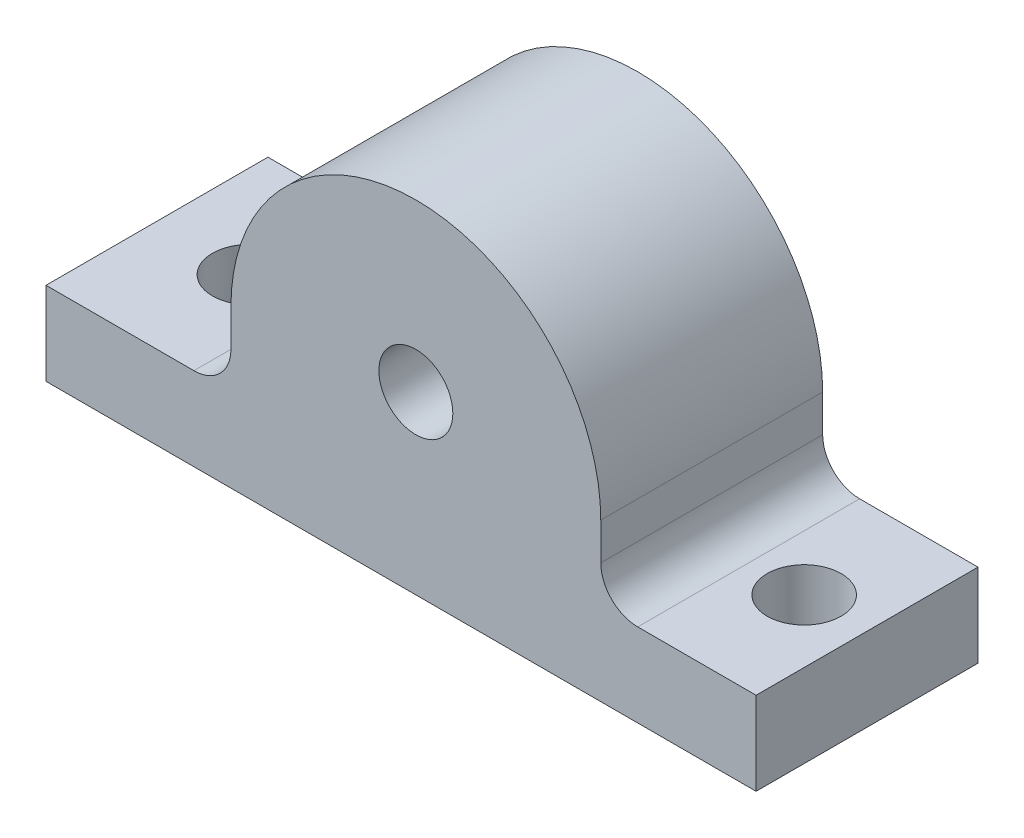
ISO-10303-21;
HEADER;
FILE_DESCRIPTION(('STEP AP214'),'2;1');
FILE_NAME('part.step','',(''),(''),'','','');
FILE_SCHEMA(('AUTOMOTIVE_DESIGN { 1 0 10303 214 1 1 1 1 }'));
ENDSEC;
DATA;
#1=APPLICATION_CONTEXT('core data for automotive mechanical design processes');
#2=APPLICATION_PROTOCOL_DEFINITION('international standard','automotive_design',2000,#1);
#3=PRODUCT_CONTEXT('',#1,'mechanical');
#4=PRODUCT('Part','Part','',(#3));
#5=PRODUCT_RELATED_PRODUCT_CATEGORY('part','',(#4));
#6=PRODUCT_DEFINITION_FORMATION('','',#4);
#7=PRODUCT_DEFINITION_CONTEXT('part definition',#1,'design');
#8=PRODUCT_DEFINITION('design','',#6,#7);
#9=PRODUCT_DEFINITION_SHAPE('','',#8);
#10=(LENGTH_UNIT() NAMED_UNIT(*) SI_UNIT(.MILLI.,.METRE.));
#11=(NAMED_UNIT(*) PLANE_ANGLE_UNIT() SI_UNIT($,.RADIAN.));
#12=(NAMED_UNIT(*) SI_UNIT($,.STERADIAN.) SOLID_ANGLE_UNIT());
#13=UNCERTAINTY_MEASURE_WITH_UNIT(LENGTH_MEASURE(1.E-05),#10,'distance_accuracy_value','');
#14=(GEOMETRIC_REPRESENTATION_CONTEXT(3) GLOBAL_UNCERTAINTY_ASSIGNED_CONTEXT((#13)) GLOBAL_UNIT_ASSIGNED_CONTEXT((#10,
#11,#12)) REPRESENTATION_CONTEXT('',''));
#15=CARTESIAN_POINT('',(0.,0.,0.));
#16=DIRECTION('',(0.,0.,1.));
#17=DIRECTION('',(1.,0.,0.));
#18=AXIS2_PLACEMENT_3D('',#15,#16,#17);
#19=CARTESIAN_POINT('',(63.5,26.9875,0.));
#20=DIRECTION('',(0.,0.,1.));
#21=DIRECTION('',(1.,0.,0.));
#22=AXIS2_PLACEMENT_3D('',#19,#20,#21);
#23=CYLINDRICAL_SURFACE('',#22,31.75);
#24=DIRECTION('',(0.,0.,-1.));
#25=VECTOR('',#24,1.);
#26=CARTESIAN_POINT('',(31.75,26.9875,0.));
#27=LINE('',#26,#25);
#28=CARTESIAN_POINT('',(31.75,26.9875,0.));
#29=VERTEX_POINT('',#28);
#30=CARTESIAN_POINT('',(31.75,26.9875,-38.1));
#31=VERTEX_POINT('',#30);
#32=EDGE_CURVE('E162',#29,#31,#27,.T.);
#33=ORIENTED_EDGE('',*,*,#32,.F.);
#34=CARTESIAN_POINT('',(63.5,26.9875,0.));
#35=DIRECTION('',(0.,0.,-1.));
#36=DIRECTION('',(-1.,0.,0.));
#37=AXIS2_PLACEMENT_3D('',#34,#35,#36);
#38=CIRCLE('',#37,31.75);
#39=CARTESIAN_POINT('',(95.25,26.9875,0.));
#40=VERTEX_POINT('',#39);
#41=EDGE_CURVE('E43',#40,#29,#38,.F.);
#42=ORIENTED_EDGE('',*,*,#41,.F.);
#43=DIRECTION('',(0.,0.,-1.));
#44=VECTOR('',#43,1.);
#45=CARTESIAN_POINT('',(95.25,26.9875,0.));
#46=LINE('',#45,#44);
#47=CARTESIAN_POINT('',(95.25,26.9875,-38.1));
#48=VERTEX_POINT('',#47);
#49=EDGE_CURVE('E165',#48,#40,#46,.F.);
#50=ORIENTED_EDGE('',*,*,#49,.F.);
#51=CARTESIAN_POINT('',(63.5,26.9875,-38.1));
#52=DIRECTION('',(0.,0.,1.));
#53=DIRECTION('',(1.,0.,0.));
#54=AXIS2_PLACEMENT_3D('',#51,#52,#53);
#55=CIRCLE('',#54,31.75);
#56=EDGE_CURVE('E11',#31,#48,#55,.F.);
#57=ORIENTED_EDGE('',*,*,#56,.F.);
#58=EDGE_LOOP('',(#33,#42,#50,#57));
#59=FACE_BOUND('',#58,.T.);
#60=ADVANCED_FACE('F35',(#59),#23,.T.);
#61=CARTESIAN_POINT('',(0.,14.2875,0.));
#62=DIRECTION('',(0.,-1.,0.));
#63=DIRECTION('',(0.,0.,-1.));
#64=AXIS2_PLACEMENT_3D('',#61,#62,#63);
#65=PLANE('',#64);
#66=CARTESIAN_POINT('',(15.875,14.2875,-19.05));
#67=DIRECTION('',(0.,-1.,0.));
#68=DIRECTION('',(0.,0.,-1.));
#69=AXIS2_PLACEMENT_3D('',#66,#67,#68);
#70=CIRCLE('',#69,6.34999999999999);
#71=CARTESIAN_POINT('',(15.875,14.2875,-25.4));
#72=VERTEX_POINT('',#71);
#73=EDGE_CURVE('E221',#72,#72,#70,.T.);
#74=ORIENTED_EDGE('',*,*,#73,.T.);
#75=EDGE_LOOP('',(#74));
#76=FACE_BOUND('',#75,.T.);
#77=DIRECTION('',(1.,0.,0.));
#78=VECTOR('',#77,1.);
#79=CARTESIAN_POINT('',(0.,14.2875,0.));
#80=LINE('',#79,#78);
#81=CARTESIAN_POINT('',(0.,14.2875,0.));
#82=VERTEX_POINT('',#81);
#83=CARTESIAN_POINT('',(25.4,14.2875,0.));
#84=VERTEX_POINT('',#83);
#85=EDGE_CURVE('E109',#82,#84,#80,.T.);
#86=ORIENTED_EDGE('',*,*,#85,.T.);
#87=DIRECTION('',(0.,0.,1.));
#88=VECTOR('',#87,1.);
#89=CARTESIAN_POINT('',(25.4,14.2875,-38.1));
#90=LINE('',#89,#88);
#91=CARTESIAN_POINT('',(25.4,14.2875,-38.1));
#92=VERTEX_POINT('',#91);
#93=EDGE_CURVE('E140',#84,#92,#90,.F.);
#94=ORIENTED_EDGE('',*,*,#93,.T.);
#95=DIRECTION('',(-1.,0.,0.));
#96=VECTOR('',#95,1.);
#97=CARTESIAN_POINT('',(0.,14.2875,-38.1));
#98=LINE('',#97,#96);
#99=CARTESIAN_POINT('',(0.,14.2875,-38.1));
#100=VERTEX_POINT('',#99);
#101=EDGE_CURVE('E127',#92,#100,#98,.T.);
#102=ORIENTED_EDGE('',*,*,#101,.T.);
#103=DIRECTION('',(0.,0.,1.));
#104=VECTOR('',#103,1.);
#105=CARTESIAN_POINT('',(0.,14.2875,0.));
#106=LINE('',#105,#104);
#107=EDGE_CURVE('E124',#100,#82,#106,.T.);
#108=ORIENTED_EDGE('',*,*,#107,.T.);
#109=EDGE_LOOP('',(#86,#94,#102,#108));
#110=FACE_BOUND('',#109,.T.);
#111=ADVANCED_FACE('F125',(#76,#110),#65,.F.);
#112=CARTESIAN_POINT('',(111.125,14.2875,-19.0500000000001));
#113=DIRECTION('',(0.,-1.,0.));
#114=DIRECTION('',(0.,0.,-1.));
#115=AXIS2_PLACEMENT_3D('',#112,#113,#114);
#116=CIRCLE('',#115,6.34999999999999);
#117=CARTESIAN_POINT('',(111.125,14.2875,-25.4000000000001));
#118=VERTEX_POINT('',#117);
#119=EDGE_CURVE('E213',#118,#118,#116,.T.);
#120=ORIENTED_EDGE('',*,*,#119,.T.);
#121=EDGE_LOOP('',(#120));
#122=FACE_BOUND('',#121,.T.);
#123=CARTESIAN_POINT('',(121.92,14.2875,-38.1));
#124=VERTEX_POINT('',#123);
#125=CARTESIAN_POINT('',(101.6,14.2875,-38.1));
#126=VERTEX_POINT('',#125);
#127=EDGE_CURVE('E180',#124,#126,#98,.T.);
#128=ORIENTED_EDGE('',*,*,#127,.T.);
#129=DIRECTION('',(0.,0.,-1.));
#130=VECTOR('',#129,1.);
#131=CARTESIAN_POINT('',(101.6,14.2875,0.));
#132=LINE('',#131,#130);
#133=CARTESIAN_POINT('',(101.6,14.2875,0.));
#134=VERTEX_POINT('',#133);
#135=EDGE_CURVE('E151',#126,#134,#132,.F.);
#136=ORIENTED_EDGE('',*,*,#135,.T.);
#137=CARTESIAN_POINT('',(121.92,14.2875,0.));
#138=VERTEX_POINT('',#137);
#139=EDGE_CURVE('E121',#134,#138,#80,.T.);
#140=ORIENTED_EDGE('',*,*,#139,.T.);
#141=DIRECTION('',(0.,0.,-1.));
#142=VECTOR('',#141,1.);
#143=CARTESIAN_POINT('',(121.92,14.2875,0.));
#144=LINE('',#143,#142);
#145=EDGE_CURVE('E120',#138,#124,#144,.T.);
#146=ORIENTED_EDGE('',*,*,#145,.T.);
#147=EDGE_LOOP('',(#128,#136,#140,#146));
#148=FACE_BOUND('',#147,.T.);
#149=ADVANCED_FACE('F202',(#122,#148),#65,.F.);
#150=CARTESIAN_POINT('',(0.,14.2875,0.));
#151=DIRECTION('',(1.,0.,0.));
#152=DIRECTION('',(0.,0.,-1.));
#153=AXIS2_PLACEMENT_3D('',#150,#151,#152);
#154=PLANE('',#153);
#155=DIRECTION('',(0.,0.,1.));
#156=VECTOR('',#155,1.);
#157=CARTESIAN_POINT('',(0.,0.,0.));
#158=LINE('',#157,#156);
#159=CARTESIAN_POINT('',(0.,0.,-38.1));
#160=VERTEX_POINT('',#159);
#161=CARTESIAN_POINT('',(0.,0.,0.));
#162=VERTEX_POINT('',#161);
#163=EDGE_CURVE('E135',#160,#162,#158,.T.);
#164=ORIENTED_EDGE('',*,*,#163,.T.);
#165=DIRECTION('',(0.,-1.,0.));
#166=VECTOR('',#165,1.);
#167=CARTESIAN_POINT('',(0.,14.2875,0.));
#168=LINE('',#167,#166);
#169=EDGE_CURVE('E114',#82,#162,#168,.T.);
#170=ORIENTED_EDGE('',*,*,#169,.F.);
#171=ORIENTED_EDGE('',*,*,#107,.F.);
#172=DIRECTION('',(0.,-1.,0.));
#173=VECTOR('',#172,1.);
#174=CARTESIAN_POINT('',(0.,14.2875,-38.1));
#175=LINE('',#174,#173);
#176=EDGE_CURVE('E182',#100,#160,#175,.T.);
#177=ORIENTED_EDGE('',*,*,#176,.T.);
#178=EDGE_LOOP('',(#164,#170,#171,#177));
#179=FACE_BOUND('',#178,.T.);
#180=ADVANCED_FACE('F133',(#179),#154,.F.);
#181=CARTESIAN_POINT('',(0.,14.2875,0.));
#182=DIRECTION('',(0.,0.,-1.));
#183=DIRECTION('',(-1.,0.,0.));
#184=AXIS2_PLACEMENT_3D('',#181,#182,#183);
#185=PLANE('',#184);
#186=CARTESIAN_POINT('',(63.5,30.1625,0.));
#187=DIRECTION('',(0.,0.,1.));
#188=DIRECTION('',(1.,0.,0.));
#189=AXIS2_PLACEMENT_3D('',#186,#187,#188);
#190=CIRCLE('',#189,6.34999999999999);
#191=CARTESIAN_POINT('',(69.85,30.1625,0.));
#192=VERTEX_POINT('',#191);
#193=EDGE_CURVE('E230',#192,#192,#190,.T.);
#194=ORIENTED_EDGE('',*,*,#193,.F.);
#195=EDGE_LOOP('',(#194));
#196=FACE_BOUND('',#195,.T.);
#197=DIRECTION('',(0.,-1.,0.));
#198=VECTOR('',#197,1.);
#199=CARTESIAN_POINT('',(95.25,58.7375,0.));
#200=LINE('',#199,#198);
#201=CARTESIAN_POINT('',(95.25,20.6375,0.));
#202=VERTEX_POINT('',#201);
#203=EDGE_CURVE('E168',#40,#202,#200,.T.);
#204=ORIENTED_EDGE('',*,*,#203,.F.);
#205=ORIENTED_EDGE('',*,*,#41,.T.);
#206=DIRECTION('',(0.,-1.,0.));
#207=VECTOR('',#206,1.);
#208=CARTESIAN_POINT('',(31.75,58.7375,0.));
#209=LINE('',#208,#207);
#210=CARTESIAN_POINT('',(31.75,20.6375,0.));
#211=VERTEX_POINT('',#210);
#212=EDGE_CURVE('E167',#29,#211,#209,.T.);
#213=ORIENTED_EDGE('',*,*,#212,.T.);
#214=CARTESIAN_POINT('',(25.4,20.6375,0.));
#215=DIRECTION('',(0.,0.,-1.));
#216=DIRECTION('',(-1.,0.,0.));
#217=AXIS2_PLACEMENT_3D('',#214,#215,#216);
#218=CIRCLE('',#217,6.35);
#219=EDGE_CURVE('E117',#211,#84,#218,.T.);
#220=ORIENTED_EDGE('',*,*,#219,.T.);
#221=ORIENTED_EDGE('',*,*,#85,.F.);
#222=ORIENTED_EDGE('',*,*,#169,.T.);
#223=DIRECTION('',(1.,0.,0.));
#224=VECTOR('',#223,1.);
#225=CARTESIAN_POINT('',(0.,0.,0.));
#226=LINE('',#225,#224);
#227=CARTESIAN_POINT('',(121.92,0.,0.));
#228=VERTEX_POINT('',#227);
#229=EDGE_CURVE('E173',#162,#228,#226,.T.);
#230=ORIENTED_EDGE('',*,*,#229,.T.);
#231=DIRECTION('',(0.,-1.,0.));
#232=VECTOR('',#231,1.);
#233=CARTESIAN_POINT('',(121.92,14.2875,0.));
#234=LINE('',#233,#232);
#235=EDGE_CURVE('E137',#138,#228,#234,.T.);
#236=ORIENTED_EDGE('',*,*,#235,.F.);
#237=ORIENTED_EDGE('',*,*,#139,.F.);
#238=CARTESIAN_POINT('',(101.6,20.6375,0.));
#239=DIRECTION('',(0.,0.,-1.));
#240=DIRECTION('',(-1.,0.,0.));
#241=AXIS2_PLACEMENT_3D('',#238,#239,#240);
#242=CIRCLE('',#241,6.35);
#243=EDGE_CURVE('E159',#134,#202,#242,.T.);
#244=ORIENTED_EDGE('',*,*,#243,.T.);
#245=EDGE_LOOP('',(#204,#205,#213,#220,#221,#222,#230,#236,#237,#244));
#246=FACE_BOUND('',#245,.T.);
#247=ADVANCED_FACE('F112',(#196,#246),#185,.F.);
#248=CARTESIAN_POINT('',(121.92,14.2875,0.));
#249=DIRECTION('',(-1.,0.,0.));
#250=DIRECTION('',(0.,0.,1.));
#251=AXIS2_PLACEMENT_3D('',#248,#249,#250);
#252=PLANE('',#251);
#253=DIRECTION('',(0.,0.,-1.));
#254=VECTOR('',#253,1.);
#255=CARTESIAN_POINT('',(121.92,0.,0.));
#256=LINE('',#255,#254);
#257=CARTESIAN_POINT('',(121.92,0.,-38.1));
#258=VERTEX_POINT('',#257);
#259=EDGE_CURVE('E185',#228,#258,#256,.T.);
#260=ORIENTED_EDGE('',*,*,#259,.T.);
#261=DIRECTION('',(0.,-1.,0.));
#262=VECTOR('',#261,1.);
#263=CARTESIAN_POINT('',(121.92,14.2875,-38.1));
#264=LINE('',#263,#262);
#265=EDGE_CURVE('E143',#124,#258,#264,.T.);
#266=ORIENTED_EDGE('',*,*,#265,.F.);
#267=ORIENTED_EDGE('',*,*,#145,.F.);
#268=ORIENTED_EDGE('',*,*,#235,.T.);
#269=EDGE_LOOP('',(#260,#266,#267,#268));
#270=FACE_BOUND('',#269,.T.);
#271=ADVANCED_FACE('F200',(#270),#252,.F.);
#272=CARTESIAN_POINT('',(0.,14.2875,-38.1));
#273=DIRECTION('',(0.,0.,1.));
#274=DIRECTION('',(1.,0.,0.));
#275=AXIS2_PLACEMENT_3D('',#272,#273,#274);
#276=PLANE('',#275);
#277=CARTESIAN_POINT('',(63.5,30.1625,-38.1));
#278=DIRECTION('',(0.,0.,1.));
#279=DIRECTION('',(1.,0.,0.));
#280=AXIS2_PLACEMENT_3D('',#277,#278,#279);
#281=CIRCLE('',#280,6.34999999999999);
#282=CARTESIAN_POINT('',(69.85,30.1625,-38.1));
#283=VERTEX_POINT('',#282);
#284=EDGE_CURVE('E227',#283,#283,#281,.T.);
#285=ORIENTED_EDGE('',*,*,#284,.T.);
#286=EDGE_LOOP('',(#285));
#287=FACE_BOUND('',#286,.T.);
#288=DIRECTION('',(0.,-1.,0.));
#289=VECTOR('',#288,1.);
#290=CARTESIAN_POINT('',(31.75,58.7375,-38.1));
#291=LINE('',#290,#289);
#292=CARTESIAN_POINT('',(31.75,20.6375,-38.1));
#293=VERTEX_POINT('',#292);
#294=EDGE_CURVE('E212',#31,#293,#291,.T.);
#295=ORIENTED_EDGE('',*,*,#294,.F.);
#296=ORIENTED_EDGE('',*,*,#56,.T.);
#297=DIRECTION('',(0.,-1.,0.));
#298=VECTOR('',#297,1.);
#299=CARTESIAN_POINT('',(95.25,58.7375,-38.1));
#300=LINE('',#299,#298);
#301=CARTESIAN_POINT('',(95.25,20.6375,-38.1));
#302=VERTEX_POINT('',#301);
#303=EDGE_CURVE('E175',#48,#302,#300,.T.);
#304=ORIENTED_EDGE('',*,*,#303,.T.);
#305=CARTESIAN_POINT('',(101.6,20.6375,-38.1));
#306=DIRECTION('',(0.,0.,1.));
#307=DIRECTION('',(1.,0.,0.));
#308=AXIS2_PLACEMENT_3D('',#305,#306,#307);
#309=CIRCLE('',#308,6.35);
#310=EDGE_CURVE('E157',#302,#126,#309,.T.);
#311=ORIENTED_EDGE('',*,*,#310,.T.);
#312=ORIENTED_EDGE('',*,*,#127,.F.);
#313=ORIENTED_EDGE('',*,*,#265,.T.);
#314=DIRECTION('',(-1.,0.,0.));
#315=VECTOR('',#314,1.);
#316=CARTESIAN_POINT('',(0.,0.,-38.1));
#317=LINE('',#316,#315);
#318=EDGE_CURVE('E131',#258,#160,#317,.T.);
#319=ORIENTED_EDGE('',*,*,#318,.T.);
#320=ORIENTED_EDGE('',*,*,#176,.F.);
#321=ORIENTED_EDGE('',*,*,#101,.F.);
#322=CARTESIAN_POINT('',(25.4,20.6375,-38.1));
#323=DIRECTION('',(0.,0.,1.));
#324=DIRECTION('',(1.,0.,0.));
#325=AXIS2_PLACEMENT_3D('',#322,#323,#324);
#326=CIRCLE('',#325,6.35);
#327=EDGE_CURVE('E154',#92,#293,#326,.T.);
#328=ORIENTED_EDGE('',*,*,#327,.T.);
#329=EDGE_LOOP('',(#295,#296,#304,#311,#312,#313,#319,#320,#321,#328));
#330=FACE_BOUND('',#329,.T.);
#331=ADVANCED_FACE('F192',(#287,#330),#276,.F.);
#332=CARTESIAN_POINT('',(0.,0.,0.));
#333=DIRECTION('',(0.,-1.,0.));
#334=DIRECTION('',(0.,0.,-1.));
#335=AXIS2_PLACEMENT_3D('',#332,#333,#334);
#336=PLANE('',#335);
#337=CARTESIAN_POINT('',(15.875,0.,-19.05));
#338=DIRECTION('',(0.,1.,0.));
#339=DIRECTION('',(0.,0.,1.));
#340=AXIS2_PLACEMENT_3D('',#337,#338,#339);
#341=CIRCLE('',#340,6.34999999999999);
#342=CARTESIAN_POINT('',(15.875,0.,-12.7));
#343=VERTEX_POINT('',#342);
#344=EDGE_CURVE('E224',#343,#343,#341,.T.);
#345=ORIENTED_EDGE('',*,*,#344,.T.);
#346=EDGE_LOOP('',(#345));
#347=FACE_BOUND('',#346,.T.);
#348=CARTESIAN_POINT('',(111.125,0.,-19.0500000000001));
#349=DIRECTION('',(0.,1.,0.));
#350=DIRECTION('',(0.,0.,1.));
#351=AXIS2_PLACEMENT_3D('',#348,#349,#350);
#352=CIRCLE('',#351,6.34999999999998);
#353=CARTESIAN_POINT('',(111.125,0.,-12.7000000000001));
#354=VERTEX_POINT('',#353);
#355=EDGE_CURVE('E218',#354,#354,#352,.T.);
#356=ORIENTED_EDGE('',*,*,#355,.T.);
#357=EDGE_LOOP('',(#356));
#358=FACE_BOUND('',#357,.T.);
#359=ORIENTED_EDGE('',*,*,#163,.F.);
#360=ORIENTED_EDGE('',*,*,#318,.F.);
#361=ORIENTED_EDGE('',*,*,#259,.F.);
#362=ORIENTED_EDGE('',*,*,#229,.F.);
#363=EDGE_LOOP('',(#359,#360,#361,#362));
#364=FACE_BOUND('',#363,.T.);
#365=ADVANCED_FACE('F197',(#347,#358,#364),#336,.T.);
#366=CARTESIAN_POINT('',(31.75,58.7375,-38.1));
#367=DIRECTION('',(1.,0.,0.));
#368=DIRECTION('',(0.,0.,-1.));
#369=AXIS2_PLACEMENT_3D('',#366,#367,#368);
#370=PLANE('',#369);
#371=ORIENTED_EDGE('',*,*,#212,.F.);
#372=ORIENTED_EDGE('',*,*,#32,.T.);
#373=ORIENTED_EDGE('',*,*,#294,.T.);
#374=DIRECTION('',(0.,0.,1.));
#375=VECTOR('',#374,1.);
#376=CARTESIAN_POINT('',(31.75,20.6375,0.));
#377=LINE('',#376,#375);
#378=EDGE_CURVE('E136',#293,#211,#377,.T.);
#379=ORIENTED_EDGE('',*,*,#378,.T.);
#380=EDGE_LOOP('',(#371,#372,#373,#379));
#381=FACE_BOUND('',#380,.T.);
#382=ADVANCED_FACE('F170',(#381),#370,.F.);
#383=CARTESIAN_POINT('',(95.25,58.7375,-38.1));
#384=DIRECTION('',(-1.,0.,0.));
#385=DIRECTION('',(0.,0.,1.));
#386=AXIS2_PLACEMENT_3D('',#383,#384,#385);
#387=PLANE('',#386);
#388=ORIENTED_EDGE('',*,*,#303,.F.);
#389=ORIENTED_EDGE('',*,*,#49,.T.);
#390=ORIENTED_EDGE('',*,*,#203,.T.);
#391=DIRECTION('',(0.,0.,-1.));
#392=VECTOR('',#391,1.);
#393=CARTESIAN_POINT('',(95.25,20.6375,-38.1));
#394=LINE('',#393,#392);
#395=EDGE_CURVE('E148',#202,#302,#394,.T.);
#396=ORIENTED_EDGE('',*,*,#395,.T.);
#397=EDGE_LOOP('',(#388,#389,#390,#396));
#398=FACE_BOUND('',#397,.T.);
#399=ADVANCED_FACE('F211',(#398),#387,.F.);
#400=CARTESIAN_POINT('',(111.125,58.7375,-19.0500000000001));
#401=DIRECTION('',(0.,1.,0.));
#402=DIRECTION('',(0.,0.,1.));
#403=AXIS2_PLACEMENT_3D('',#400,#401,#402);
#404=CYLINDRICAL_SURFACE('',#403,6.34999999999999);
#405=ORIENTED_EDGE('',*,*,#355,.F.);
#406=EDGE_LOOP('',(#405));
#407=FACE_BOUND('',#406,.T.);
#408=ORIENTED_EDGE('',*,*,#119,.F.);
#409=EDGE_LOOP('',(#408));
#410=FACE_BOUND('',#409,.T.);
#411=ADVANCED_FACE('F276',(#407,#410),#404,.F.);
#412=CARTESIAN_POINT('',(15.875,58.7375,-19.05));
#413=DIRECTION('',(0.,1.,0.));
#414=DIRECTION('',(0.,0.,1.));
#415=AXIS2_PLACEMENT_3D('',#412,#413,#414);
#416=CYLINDRICAL_SURFACE('',#415,6.34999999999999);
#417=ORIENTED_EDGE('',*,*,#344,.F.);
#418=EDGE_LOOP('',(#417));
#419=FACE_BOUND('',#418,.T.);
#420=ORIENTED_EDGE('',*,*,#73,.F.);
#421=EDGE_LOOP('',(#420));
#422=FACE_BOUND('',#421,.T.);
#423=ADVANCED_FACE('F268',(#419,#422),#416,.F.);
#424=CARTESIAN_POINT('',(63.5,30.1625,0.));
#425=DIRECTION('',(0.,0.,1.));
#426=DIRECTION('',(1.,0.,0.));
#427=AXIS2_PLACEMENT_3D('',#424,#425,#426);
#428=CYLINDRICAL_SURFACE('',#427,6.34999999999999);
#429=ORIENTED_EDGE('',*,*,#284,.F.);
#430=EDGE_LOOP('',(#429));
#431=FACE_BOUND('',#430,.T.);
#432=ORIENTED_EDGE('',*,*,#193,.T.);
#433=EDGE_LOOP('',(#432));
#434=FACE_BOUND('',#433,.T.);
#435=ADVANCED_FACE('F234',(#431,#434),#428,.F.);
#436=CARTESIAN_POINT('',(25.4,20.6375,-38.1));
#437=DIRECTION('',(0.,0.,-1.));
#438=DIRECTION('',(-1.,0.,0.));
#439=AXIS2_PLACEMENT_3D('',#436,#437,#438);
#440=CYLINDRICAL_SURFACE('',#439,6.35);
#441=ORIENTED_EDGE('',*,*,#327,.F.);
#442=ORIENTED_EDGE('',*,*,#93,.F.);
#443=ORIENTED_EDGE('',*,*,#219,.F.);
#444=ORIENTED_EDGE('',*,*,#378,.F.);
#445=EDGE_LOOP('',(#441,#442,#443,#444));
#446=FACE_BOUND('',#445,.T.);
#447=ADVANCED_FACE('F267',(#446),#440,.F.);
#448=CARTESIAN_POINT('',(101.6,20.6375,-38.1));
#449=DIRECTION('',(0.,0.,1.));
#450=DIRECTION('',(1.,0.,0.));
#451=AXIS2_PLACEMENT_3D('',#448,#449,#450);
#452=CYLINDRICAL_SURFACE('',#451,6.35);
#453=ORIENTED_EDGE('',*,*,#243,.F.);
#454=ORIENTED_EDGE('',*,*,#135,.F.);
#455=ORIENTED_EDGE('',*,*,#310,.F.);
#456=ORIENTED_EDGE('',*,*,#395,.F.);
#457=EDGE_LOOP('',(#453,#454,#455,#456));
#458=FACE_BOUND('',#457,.T.);
#459=ADVANCED_FACE('F207',(#458),#452,.F.);
#460=CLOSED_SHELL('',(#60,#111,#149,#180,#247,#271,#331,#365,#382,#399,#411,#423,#435,#447,#459));
#461=MANIFOLD_SOLID_BREP('B2',#460);
#462=ADVANCED_BREP_SHAPE_REPRESENTATION('',(#18,#461),#14);
#463=SHAPE_DEFINITION_REPRESENTATION(#9,#462);
ENDSEC;
END-ISO-10303-21;
